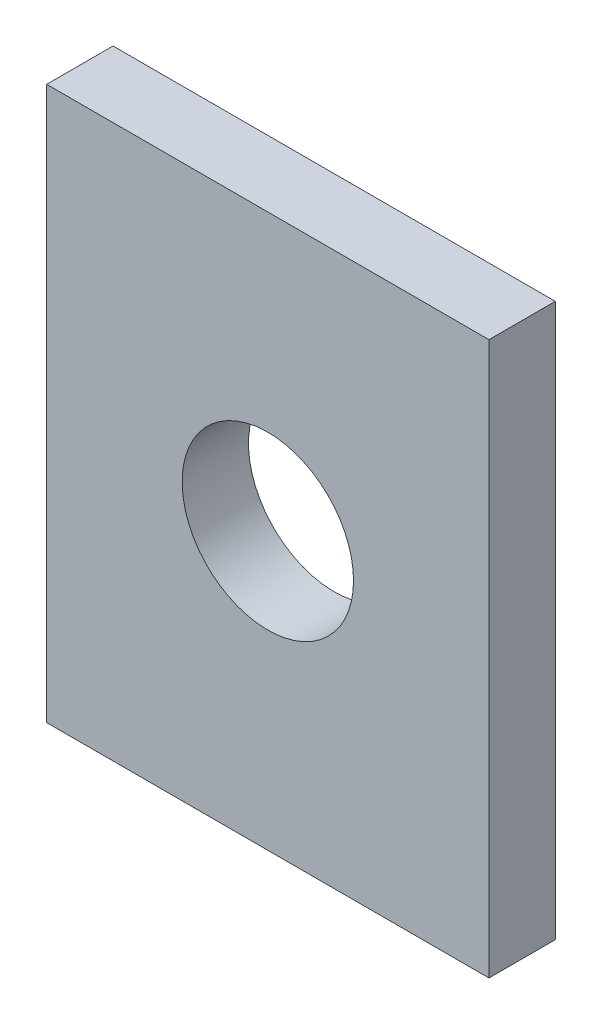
ISO-10303-21;
HEADER;
FILE_DESCRIPTION(('STEP AP214'),'2;1');
FILE_NAME('part.step','',(''),(''),'','','');
FILE_SCHEMA(('AUTOMOTIVE_DESIGN { 1 0 10303 214 1 1 1 1 }'));
ENDSEC;
DATA;
#1=APPLICATION_CONTEXT('core data for automotive mechanical design processes');
#2=APPLICATION_PROTOCOL_DEFINITION('international standard','automotive_design',2000,#1);
#3=PRODUCT_CONTEXT('',#1,'mechanical');
#4=PRODUCT('Part','Part','',(#3));
#5=PRODUCT_RELATED_PRODUCT_CATEGORY('part','',(#4));
#6=PRODUCT_DEFINITION_FORMATION('','',#4);
#7=PRODUCT_DEFINITION_CONTEXT('part definition',#1,'design');
#8=PRODUCT_DEFINITION('design','',#6,#7);
#9=PRODUCT_DEFINITION_SHAPE('','',#8);
#10=(LENGTH_UNIT() NAMED_UNIT(*) SI_UNIT(.MILLI.,.METRE.));
#11=(NAMED_UNIT(*) PLANE_ANGLE_UNIT() SI_UNIT($,.RADIAN.));
#12=(NAMED_UNIT(*) SI_UNIT($,.STERADIAN.) SOLID_ANGLE_UNIT());
#13=UNCERTAINTY_MEASURE_WITH_UNIT(LENGTH_MEASURE(1.E-05),#10,'distance_accuracy_value','');
#14=(GEOMETRIC_REPRESENTATION_CONTEXT(3) GLOBAL_UNCERTAINTY_ASSIGNED_CONTEXT((#13)) GLOBAL_UNIT_ASSIGNED_CONTEXT((#10,
#11,#12)) REPRESENTATION_CONTEXT('',''));
#15=CARTESIAN_POINT('',(0.,0.,0.));
#16=DIRECTION('',(0.,0.,1.));
#17=DIRECTION('',(1.,0.,0.));
#18=AXIS2_PLACEMENT_3D('',#15,#16,#17);
#19=CARTESIAN_POINT('',(0.,0.,12.));
#20=DIRECTION('',(0.,0.,1.));
#21=DIRECTION('',(1.,0.,0.));
#22=AXIS2_PLACEMENT_3D('',#19,#20,#21);
#23=PLANE('',#22);
#24=CARTESIAN_POINT('',(0.,0.,12.));
#25=DIRECTION('',(0.,0.,1.));
#26=DIRECTION('',(1.,0.,0.));
#27=AXIS2_PLACEMENT_3D('',#24,#25,#26);
#28=CIRCLE('',#27,15.5);
#29=CARTESIAN_POINT('',(15.5,0.,12.));
#30=VERTEX_POINT('',#29);
#31=EDGE_CURVE('E20',#30,#30,#28,.T.);
#32=ORIENTED_EDGE('',*,*,#31,.F.);
#33=EDGE_LOOP('',(#32));
#34=FACE_BOUND('',#33,.T.);
#35=DIRECTION('',(1.,0.,0.));
#36=VECTOR('',#35,1.);
#37=CARTESIAN_POINT('',(-40.,-50.,12.));
#38=LINE('',#37,#36);
#39=CARTESIAN_POINT('',(-40.,-50.,12.));
#40=VERTEX_POINT('',#39);
#41=CARTESIAN_POINT('',(40.,-50.,12.));
#42=VERTEX_POINT('',#41);
#43=EDGE_CURVE('E95',#40,#42,#38,.T.);
#44=ORIENTED_EDGE('',*,*,#43,.T.);
#45=DIRECTION('',(0.,1.,0.));
#46=VECTOR('',#45,1.);
#47=CARTESIAN_POINT('',(40.,-50.,12.));
#48=LINE('',#47,#46);
#49=CARTESIAN_POINT('',(40.,50.,12.));
#50=VERTEX_POINT('',#49);
#51=EDGE_CURVE('E93',#42,#50,#48,.T.);
#52=ORIENTED_EDGE('',*,*,#51,.T.);
#53=DIRECTION('',(-1.,0.,0.));
#54=VECTOR('',#53,1.);
#55=CARTESIAN_POINT('',(40.,50.,12.));
#56=LINE('',#55,#54);
#57=CARTESIAN_POINT('',(-40.,50.,12.));
#58=VERTEX_POINT('',#57);
#59=EDGE_CURVE('E79',#50,#58,#56,.T.);
#60=ORIENTED_EDGE('',*,*,#59,.T.);
#61=DIRECTION('',(0.,-1.,0.));
#62=VECTOR('',#61,1.);
#63=CARTESIAN_POINT('',(-40.,50.,12.));
#64=LINE('',#63,#62);
#65=EDGE_CURVE('E112',#58,#40,#64,.T.);
#66=ORIENTED_EDGE('',*,*,#65,.T.);
#67=EDGE_LOOP('',(#44,#52,#60,#66));
#68=FACE_BOUND('',#67,.T.);
#69=ADVANCED_FACE('F16',(#34,#68),#23,.T.);
#70=CARTESIAN_POINT('',(0.,0.,0.));
#71=DIRECTION('',(0.,0.,1.));
#72=DIRECTION('',(1.,0.,0.));
#73=AXIS2_PLACEMENT_3D('',#70,#71,#72);
#74=PLANE('',#73);
#75=CARTESIAN_POINT('',(0.,0.,0.));
#76=DIRECTION('',(0.,0.,1.));
#77=DIRECTION('',(1.,0.,0.));
#78=AXIS2_PLACEMENT_3D('',#75,#76,#77);
#79=CIRCLE('',#78,15.5);
#80=CARTESIAN_POINT('',(15.5,0.,0.));
#81=VERTEX_POINT('',#80);
#82=EDGE_CURVE('E10',#81,#81,#79,.T.);
#83=ORIENTED_EDGE('',*,*,#82,.T.);
#84=EDGE_LOOP('',(#83));
#85=FACE_BOUND('',#84,.T.);
#86=DIRECTION('',(0.,-1.,0.));
#87=VECTOR('',#86,1.);
#88=CARTESIAN_POINT('',(-40.,50.,0.));
#89=LINE('',#88,#87);
#90=CARTESIAN_POINT('',(-40.,50.,0.));
#91=VERTEX_POINT('',#90);
#92=CARTESIAN_POINT('',(-40.,-50.,0.));
#93=VERTEX_POINT('',#92);
#94=EDGE_CURVE('E90',#91,#93,#89,.T.);
#95=ORIENTED_EDGE('',*,*,#94,.F.);
#96=DIRECTION('',(-1.,0.,0.));
#97=VECTOR('',#96,1.);
#98=CARTESIAN_POINT('',(40.,50.,0.));
#99=LINE('',#98,#97);
#100=CARTESIAN_POINT('',(40.,50.,0.));
#101=VERTEX_POINT('',#100);
#102=EDGE_CURVE('E100',#101,#91,#99,.T.);
#103=ORIENTED_EDGE('',*,*,#102,.F.);
#104=DIRECTION('',(0.,1.,0.));
#105=VECTOR('',#104,1.);
#106=CARTESIAN_POINT('',(40.,-50.,0.));
#107=LINE('',#106,#105);
#108=CARTESIAN_POINT('',(40.,-50.,0.));
#109=VERTEX_POINT('',#108);
#110=EDGE_CURVE('E103',#109,#101,#107,.T.);
#111=ORIENTED_EDGE('',*,*,#110,.F.);
#112=DIRECTION('',(1.,0.,0.));
#113=VECTOR('',#112,1.);
#114=CARTESIAN_POINT('',(-40.,-50.,0.));
#115=LINE('',#114,#113);
#116=EDGE_CURVE('E192',#93,#109,#115,.T.);
#117=ORIENTED_EDGE('',*,*,#116,.F.);
#118=EDGE_LOOP('',(#95,#103,#111,#117));
#119=FACE_BOUND('',#118,.T.);
#120=ADVANCED_FACE('F18',(#85,#119),#74,.F.);
#121=CARTESIAN_POINT('',(0.,0.,0.));
#122=DIRECTION('',(0.,0.,-1.));
#123=DIRECTION('',(1.,0.,0.));
#124=AXIS2_PLACEMENT_3D('',#121,#122,#123);
#125=CYLINDRICAL_SURFACE('',#124,15.5);
#126=DIRECTION('',(0.,0.,1.));
#127=VECTOR('',#126,1.);
#128=CARTESIAN_POINT('',(15.5,0.,0.));
#129=LINE('',#128,#127);
#130=EDGE_CURVE('E114',#81,#30,#129,.T.);
#131=ORIENTED_EDGE('',*,*,#130,.T.);
#132=ORIENTED_EDGE('',*,*,#31,.T.);
#133=ORIENTED_EDGE('',*,*,#130,.F.);
#134=ORIENTED_EDGE('',*,*,#82,.F.);
#135=EDGE_LOOP('',(#131,#132,#133,#134));
#136=FACE_BOUND('',#135,.T.);
#137=ADVANCED_FACE('F163',(#136),#125,.F.);
#138=CARTESIAN_POINT('',(-40.,50.,0.));
#139=DIRECTION('',(1.,0.,0.));
#140=DIRECTION('',(0.,1.,0.));
#141=AXIS2_PLACEMENT_3D('',#138,#139,#140);
#142=PLANE('',#141);
#143=ORIENTED_EDGE('',*,*,#94,.T.);
#144=DIRECTION('',(0.,0.,1.));
#145=VECTOR('',#144,1.);
#146=CARTESIAN_POINT('',(-40.,-50.,0.));
#147=LINE('',#146,#145);
#148=EDGE_CURVE('E109',#93,#40,#147,.T.);
#149=ORIENTED_EDGE('',*,*,#148,.T.);
#150=ORIENTED_EDGE('',*,*,#65,.F.);
#151=DIRECTION('',(0.,0.,1.));
#152=VECTOR('',#151,1.);
#153=CARTESIAN_POINT('',(-40.,50.,0.));
#154=LINE('',#153,#152);
#155=EDGE_CURVE('E87',#91,#58,#154,.T.);
#156=ORIENTED_EDGE('',*,*,#155,.F.);
#157=EDGE_LOOP('',(#143,#149,#150,#156));
#158=FACE_BOUND('',#157,.T.);
#159=ADVANCED_FACE('F155',(#158),#142,.F.);
#160=CARTESIAN_POINT('',(40.,50.,0.));
#161=DIRECTION('',(0.,-1.,0.));
#162=DIRECTION('',(0.,0.,-1.));
#163=AXIS2_PLACEMENT_3D('',#160,#161,#162);
#164=PLANE('',#163);
#165=ORIENTED_EDGE('',*,*,#102,.T.);
#166=ORIENTED_EDGE('',*,*,#155,.T.);
#167=ORIENTED_EDGE('',*,*,#59,.F.);
#168=DIRECTION('',(0.,0.,1.));
#169=VECTOR('',#168,1.);
#170=CARTESIAN_POINT('',(40.,50.,0.));
#171=LINE('',#170,#169);
#172=EDGE_CURVE('E84',#101,#50,#171,.T.);
#173=ORIENTED_EDGE('',*,*,#172,.F.);
#174=EDGE_LOOP('',(#165,#166,#167,#173));
#175=FACE_BOUND('',#174,.T.);
#176=ADVANCED_FACE('F82',(#175),#164,.F.);
#177=CARTESIAN_POINT('',(40.,-50.,0.));
#178=DIRECTION('',(-1.,0.,0.));
#179=DIRECTION('',(0.,0.,1.));
#180=AXIS2_PLACEMENT_3D('',#177,#178,#179);
#181=PLANE('',#180);
#182=ORIENTED_EDGE('',*,*,#110,.T.);
#183=ORIENTED_EDGE('',*,*,#172,.T.);
#184=ORIENTED_EDGE('',*,*,#51,.F.);
#185=DIRECTION('',(0.,0.,1.));
#186=VECTOR('',#185,1.);
#187=CARTESIAN_POINT('',(40.,-50.,0.));
#188=LINE('',#187,#186);
#189=EDGE_CURVE('E199',#109,#42,#188,.T.);
#190=ORIENTED_EDGE('',*,*,#189,.F.);
#191=EDGE_LOOP('',(#182,#183,#184,#190));
#192=FACE_BOUND('',#191,.T.);
#193=ADVANCED_FACE('F102',(#192),#181,.F.);
#194=CARTESIAN_POINT('',(-40.,-50.,0.));
#195=DIRECTION('',(0.,1.,0.));
#196=DIRECTION('',(1.,0.,0.));
#197=AXIS2_PLACEMENT_3D('',#194,#195,#196);
#198=PLANE('',#197);
#199=ORIENTED_EDGE('',*,*,#116,.T.);
#200=ORIENTED_EDGE('',*,*,#189,.T.);
#201=ORIENTED_EDGE('',*,*,#43,.F.);
#202=ORIENTED_EDGE('',*,*,#148,.F.);
#203=EDGE_LOOP('',(#199,#200,#201,#202));
#204=FACE_BOUND('',#203,.T.);
#205=ADVANCED_FACE('F135',(#204),#198,.F.);
#206=CLOSED_SHELL('',(#69,#120,#137,#159,#176,#193,#205));
#207=MANIFOLD_SOLID_BREP('B1',#206);
#208=ADVANCED_BREP_SHAPE_REPRESENTATION('',(#18,#207),#14);
#209=SHAPE_DEFINITION_REPRESENTATION(#9,#208);
ENDSEC;
END-ISO-10303-21;
